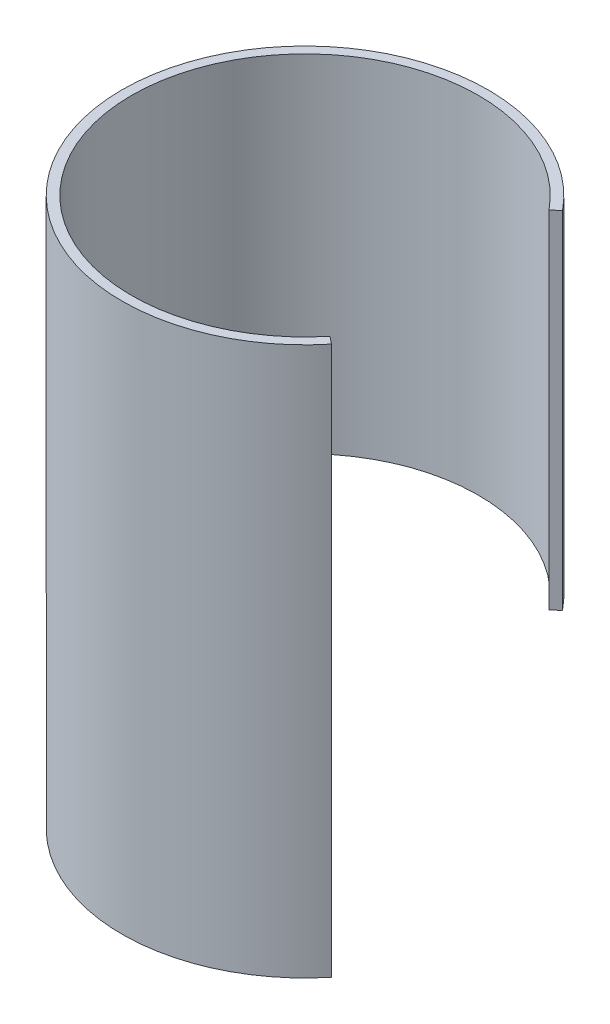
ISO-10303-21;
HEADER;
FILE_DESCRIPTION(('STEP AP214'),'2;1');
FILE_NAME('part.step','',(''),(''),'','','');
FILE_SCHEMA(('AUTOMOTIVE_DESIGN { 1 0 10303 214 1 1 1 1 }'));
ENDSEC;
DATA;
#1=APPLICATION_CONTEXT('core data for automotive mechanical design processes');
#2=APPLICATION_PROTOCOL_DEFINITION('international standard','automotive_design',2000,#1);
#3=PRODUCT_CONTEXT('',#1,'mechanical');
#4=PRODUCT('Part','Part','',(#3));
#5=PRODUCT_RELATED_PRODUCT_CATEGORY('part','',(#4));
#6=PRODUCT_DEFINITION_FORMATION('','',#4);
#7=PRODUCT_DEFINITION_CONTEXT('part definition',#1,'design');
#8=PRODUCT_DEFINITION('design','',#6,#7);
#9=PRODUCT_DEFINITION_SHAPE('','',#8);
#10=(LENGTH_UNIT() NAMED_UNIT(*) SI_UNIT(.MILLI.,.METRE.));
#11=(NAMED_UNIT(*) PLANE_ANGLE_UNIT() SI_UNIT($,.RADIAN.));
#12=(NAMED_UNIT(*) SI_UNIT($,.STERADIAN.) SOLID_ANGLE_UNIT());
#13=UNCERTAINTY_MEASURE_WITH_UNIT(LENGTH_MEASURE(1.E-05),#10,'distance_accuracy_value','');
#14=(GEOMETRIC_REPRESENTATION_CONTEXT(3) GLOBAL_UNCERTAINTY_ASSIGNED_CONTEXT((#13)) GLOBAL_UNIT_ASSIGNED_CONTEXT((#10,
#11,#12)) REPRESENTATION_CONTEXT('',''));
#15=CARTESIAN_POINT('',(0.,0.,0.));
#16=DIRECTION('',(0.,0.,1.));
#17=DIRECTION('',(1.,0.,0.));
#18=AXIS2_PLACEMENT_3D('',#15,#16,#17);
#19=CARTESIAN_POINT('',(0.,0.,0.));
#20=DIRECTION('',(0.,1.,0.));
#21=DIRECTION('',(0.,0.,1.));
#22=AXIS2_PLACEMENT_3D('',#19,#20,#21);
#23=CYLINDRICAL_SURFACE('',#22,36.05);
#24=CARTESIAN_POINT('',(0.,114.,0.));
#25=DIRECTION('',(0.,1.,0.));
#26=DIRECTION('',(0.,0.,1.));
#27=AXIS2_PLACEMENT_3D('',#24,#25,#26);
#28=CIRCLE('',#27,36.05);
#29=CARTESIAN_POINT('',(27.9566215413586,114.,22.7602682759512));
#30=VERTEX_POINT('',#29);
#31=CARTESIAN_POINT('',(27.9566215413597,114.,-22.7602682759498));
#32=VERTEX_POINT('',#31);
#33=EDGE_CURVE('E127',#30,#32,#28,.F.);
#34=ORIENTED_EDGE('',*,*,#33,.F.);
#35=DIRECTION('',(0.,1.,0.));
#36=VECTOR('',#35,1.);
#37=CARTESIAN_POINT('',(27.9566215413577,0.,22.7602682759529));
#38=LINE('',#37,#36);
#39=CARTESIAN_POINT('',(27.9566215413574,0.,22.7602682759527));
#40=VERTEX_POINT('',#39);
#41=EDGE_CURVE('E110',#40,#30,#38,.T.);
#42=ORIENTED_EDGE('',*,*,#41,.F.);
#43=CARTESIAN_POINT('',(0.,0.,0.));
#44=DIRECTION('',(0.,1.,0.));
#45=DIRECTION('',(0.,0.,1.));
#46=AXIS2_PLACEMENT_3D('',#43,#44,#45);
#47=CIRCLE('',#46,36.05);
#48=CARTESIAN_POINT('',(-35.7015755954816,0.,-5.));
#49=VERTEX_POINT('',#48);
#50=EDGE_CURVE('E113',#40,#49,#47,.F.);
#51=ORIENTED_EDGE('',*,*,#50,.T.);
#52=DIRECTION('',(0.,1.,0.));
#53=VECTOR('',#52,1.);
#54=CARTESIAN_POINT('',(-35.70157559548,18.61324865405,-5.));
#55=LINE('',#54,#53);
#56=CARTESIAN_POINT('',(-35.7015755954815,18.6132486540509,-5.));
#57=VERTEX_POINT('',#56);
#58=EDGE_CURVE('E81',#49,#57,#55,.T.);
#59=ORIENTED_EDGE('',*,*,#58,.T.);
#60=CARTESIAN_POINT('',(0.,21.5,0.));
#61=DIRECTION('',(0.,-0.866025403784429,0.500000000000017));
#62=DIRECTION('',(0.,0.500000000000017,0.866025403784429));
#63=AXIS2_PLACEMENT_3D('',#60,#61,#62);
#64=ELLIPSE('',#63,41.6269544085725,36.05);
#65=CARTESIAN_POINT('',(-36.05,21.5,0.));
#66=VERTEX_POINT('',#65);
#67=EDGE_CURVE('E21',#57,#66,#64,.F.);
#68=ORIENTED_EDGE('',*,*,#67,.T.);
#69=DIRECTION('',(0.,1.,0.));
#70=VECTOR('',#69,1.);
#71=CARTESIAN_POINT('',(-36.05,42.,0.));
#72=LINE('',#71,#70);
#73=CARTESIAN_POINT('',(-36.05,42.,0.));
#74=VERTEX_POINT('',#73);
#75=EDGE_CURVE('E86',#66,#74,#72,.T.);
#76=ORIENTED_EDGE('',*,*,#75,.T.);
#77=CARTESIAN_POINT('',(0.,42.,0.));
#78=DIRECTION('',(0.,1.,0.));
#79=DIRECTION('',(0.,0.,1.));
#80=AXIS2_PLACEMENT_3D('',#77,#78,#79);
#81=CIRCLE('',#80,36.05);
#82=CARTESIAN_POINT('',(27.9566215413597,42.,-22.7602682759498));
#83=VERTEX_POINT('',#82);
#84=EDGE_CURVE('E125',#74,#83,#81,.F.);
#85=ORIENTED_EDGE('',*,*,#84,.T.);
#86=DIRECTION('',(0.,1.,0.));
#87=VECTOR('',#86,1.);
#88=CARTESIAN_POINT('',(27.95662154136,0.,-22.76026827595));
#89=LINE('',#88,#87);
#90=EDGE_CURVE('E107',#32,#83,#89,.F.);
#91=ORIENTED_EDGE('',*,*,#90,.F.);
#92=EDGE_LOOP('',(#34,#42,#51,#59,#68,#76,#85,#91));
#93=FACE_BOUND('',#92,.T.);
#94=ADVANCED_FACE('F18',(#93),#23,.F.);
#95=CARTESIAN_POINT('',(36.26337433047,42.,0.));
#96=DIRECTION('',(0.,0.,1.));
#97=DIRECTION('',(1.,0.,0.));
#98=AXIS2_PLACEMENT_3D('',#95,#96,#97);
#99=PLANE('',#98);
#100=DIRECTION('',(1.,0.,0.));
#101=VECTOR('',#100,1.);
#102=CARTESIAN_POINT('',(36.26337433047,21.5,0.));
#103=LINE('',#102,#101);
#104=CARTESIAN_POINT('',(-38.05,21.5,0.));
#105=VERTEX_POINT('',#104);
#106=EDGE_CURVE('E89',#66,#105,#103,.F.);
#107=ORIENTED_EDGE('',*,*,#106,.T.);
#108=DIRECTION('',(0.,1.,0.));
#109=VECTOR('',#108,1.);
#110=CARTESIAN_POINT('',(-38.05,0.,0.));
#111=LINE('',#110,#109);
#112=CARTESIAN_POINT('',(-38.05,42.,0.));
#113=VERTEX_POINT('',#112);
#114=EDGE_CURVE('E124',#113,#105,#111,.F.);
#115=ORIENTED_EDGE('',*,*,#114,.F.);
#116=DIRECTION('',(1.,0.,0.));
#117=VECTOR('',#116,1.);
#118=CARTESIAN_POINT('',(36.26337433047,42.,0.));
#119=LINE('',#118,#117);
#120=EDGE_CURVE('E92',#113,#74,#119,.T.);
#121=ORIENTED_EDGE('',*,*,#120,.T.);
#122=ORIENTED_EDGE('',*,*,#75,.F.);
#123=EDGE_LOOP('',(#107,#115,#121,#122));
#124=FACE_BOUND('',#123,.T.);
#125=ADVANCED_FACE('F87',(#124),#99,.F.);
#126=CARTESIAN_POINT('',(36.26337433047,21.5,0.));
#127=DIRECTION('',(0.,-0.866025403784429,0.500000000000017));
#128=DIRECTION('',(0.,-0.500000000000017,-0.866025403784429));
#129=AXIS2_PLACEMENT_3D('',#126,#127,#128);
#130=PLANE('',#129);
#131=DIRECTION('',(1.,0.,0.));
#132=VECTOR('',#131,1.);
#133=CARTESIAN_POINT('',(36.26337433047,18.61324865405,-5.));
#134=LINE('',#133,#132);
#135=CARTESIAN_POINT('',(-37.7200543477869,18.613248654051,-4.99999999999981));
#136=VERTEX_POINT('',#135);
#137=EDGE_CURVE('E105',#57,#136,#134,.F.);
#138=ORIENTED_EDGE('',*,*,#137,.T.);
#139=CARTESIAN_POINT('',(0.,21.5,0.));
#140=DIRECTION('',(0.,-0.866025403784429,0.500000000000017));
#141=DIRECTION('',(0.,0.500000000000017,0.866025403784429));
#142=AXIS2_PLACEMENT_3D('',#139,#140,#141);
#143=ELLIPSE('',#142,43.936355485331,38.05);
#144=EDGE_CURVE('E100',#105,#136,#143,.T.);
#145=ORIENTED_EDGE('',*,*,#144,.F.);
#146=ORIENTED_EDGE('',*,*,#106,.F.);
#147=ORIENTED_EDGE('',*,*,#67,.F.);
#148=EDGE_LOOP('',(#138,#145,#146,#147));
#149=FACE_BOUND('',#148,.T.);
#150=ADVANCED_FACE('F98',(#149),#130,.F.);
#151=CARTESIAN_POINT('',(36.26337433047,18.61324865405,-5.));
#152=DIRECTION('',(0.,0.,1.));
#153=DIRECTION('',(1.,0.,0.));
#154=AXIS2_PLACEMENT_3D('',#151,#152,#153);
#155=PLANE('',#154);
#156=ORIENTED_EDGE('',*,*,#137,.F.);
#157=ORIENTED_EDGE('',*,*,#58,.F.);
#158=DIRECTION('',(1.,0.,0.));
#159=VECTOR('',#158,1.);
#160=CARTESIAN_POINT('',(0.,0.,-5.));
#161=LINE('',#160,#159);
#162=CARTESIAN_POINT('',(-37.720054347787,0.,-4.99999999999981));
#163=VERTEX_POINT('',#162);
#164=EDGE_CURVE('E129',#49,#163,#161,.F.);
#165=ORIENTED_EDGE('',*,*,#164,.T.);
#166=DIRECTION('',(0.,1.,0.));
#167=VECTOR('',#166,1.);
#168=CARTESIAN_POINT('',(-37.720054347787,0.,-4.99999999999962));
#169=LINE('',#168,#167);
#170=EDGE_CURVE('E122',#136,#163,#169,.F.);
#171=ORIENTED_EDGE('',*,*,#170,.F.);
#172=EDGE_LOOP('',(#156,#157,#165,#171));
#173=FACE_BOUND('',#172,.T.);
#174=ADVANCED_FACE('F152',(#173),#155,.F.);
#175=CARTESIAN_POINT('',(0.,0.,0.));
#176=DIRECTION('',(0.,1.,0.));
#177=DIRECTION('',(0.,0.,1.));
#178=AXIS2_PLACEMENT_3D('',#175,#176,#177);
#179=PLANE('',#178);
#180=DIRECTION('',(-0.77549574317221,0.,-0.631352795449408));
#181=VECTOR('',#180,1.);
#182=CARTESIAN_POINT('',(29.5076130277,0.,24.02297386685));
#183=LINE('',#182,#181);
#184=CARTESIAN_POINT('',(29.5076130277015,0.,24.0229738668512));
#185=VERTEX_POINT('',#184);
#186=EDGE_CURVE('E112',#185,#40,#183,.T.);
#187=ORIENTED_EDGE('',*,*,#186,.F.);
#188=CARTESIAN_POINT('',(0.,0.,0.));
#189=DIRECTION('',(0.,1.,0.));
#190=DIRECTION('',(0.,0.,1.));
#191=AXIS2_PLACEMENT_3D('',#188,#189,#190);
#192=CIRCLE('',#191,38.05);
#193=EDGE_CURVE('E119',#163,#185,#192,.T.);
#194=ORIENTED_EDGE('',*,*,#193,.F.);
#195=ORIENTED_EDGE('',*,*,#164,.F.);
#196=ORIENTED_EDGE('',*,*,#50,.F.);
#197=EDGE_LOOP('',(#187,#194,#195,#196));
#198=FACE_BOUND('',#197,.T.);
#199=ADVANCED_FACE('F154',(#198),#179,.F.);
#200=CARTESIAN_POINT('',(29.5076130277,0.,24.02297386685));
#201=DIRECTION('',(0.631352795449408,0.,-0.77549574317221));
#202=DIRECTION('',(-0.77549574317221,0.,-0.631352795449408));
#203=AXIS2_PLACEMENT_3D('',#200,#201,#202);
#204=PLANE('',#203);
#205=DIRECTION('',(0.,1.,0.));
#206=VECTOR('',#205,1.);
#207=CARTESIAN_POINT('',(29.5076130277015,0.,24.0229738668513));
#208=LINE('',#207,#206);
#209=CARTESIAN_POINT('',(29.5076130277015,114.,24.0229738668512));
#210=VERTEX_POINT('',#209);
#211=EDGE_CURVE('E118',#185,#210,#208,.T.);
#212=ORIENTED_EDGE('',*,*,#211,.F.);
#213=ORIENTED_EDGE('',*,*,#186,.T.);
#214=ORIENTED_EDGE('',*,*,#41,.T.);
#215=DIRECTION('',(-0.775495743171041,0.,-0.631352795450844));
#216=VECTOR('',#215,1.);
#217=CARTESIAN_POINT('',(29.5076130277,114.,24.02297386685));
#218=LINE('',#217,#216);
#219=EDGE_CURVE('E128',#210,#30,#218,.T.);
#220=ORIENTED_EDGE('',*,*,#219,.F.);
#221=EDGE_LOOP('',(#212,#213,#214,#220));
#222=FACE_BOUND('',#221,.T.);
#223=ADVANCED_FACE('F161',(#222),#204,.T.);
#224=CARTESIAN_POINT('',(0.,114.,0.));
#225=DIRECTION('',(0.,1.,0.));
#226=DIRECTION('',(0.,0.,1.));
#227=AXIS2_PLACEMENT_3D('',#224,#225,#226);
#228=PLANE('',#227);
#229=DIRECTION('',(0.77549574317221,0.,-0.631352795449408));
#230=VECTOR('',#229,1.);
#231=CARTESIAN_POINT('',(27.95662154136,114.,-22.76026827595));
#232=LINE('',#231,#230);
#233=CARTESIAN_POINT('',(29.5076130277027,114.,-24.0229738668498));
#234=VERTEX_POINT('',#233);
#235=EDGE_CURVE('E108',#234,#32,#232,.F.);
#236=ORIENTED_EDGE('',*,*,#235,.F.);
#237=CARTESIAN_POINT('',(0.,114.,0.));
#238=DIRECTION('',(0.,1.,0.));
#239=DIRECTION('',(0.,0.,1.));
#240=AXIS2_PLACEMENT_3D('',#237,#238,#239);
#241=CIRCLE('',#240,38.05);
#242=EDGE_CURVE('E115',#210,#234,#241,.F.);
#243=ORIENTED_EDGE('',*,*,#242,.F.);
#244=ORIENTED_EDGE('',*,*,#219,.T.);
#245=ORIENTED_EDGE('',*,*,#33,.T.);
#246=EDGE_LOOP('',(#236,#243,#244,#245));
#247=FACE_BOUND('',#246,.T.);
#248=ADVANCED_FACE('F176',(#247),#228,.T.);
#249=CARTESIAN_POINT('',(27.95662154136,0.,-22.76026827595));
#250=DIRECTION('',(0.631352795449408,0.,0.77549574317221));
#251=DIRECTION('',(0.77549574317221,0.,-0.631352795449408));
#252=AXIS2_PLACEMENT_3D('',#249,#250,#251);
#253=PLANE('',#252);
#254=ORIENTED_EDGE('',*,*,#90,.T.);
#255=DIRECTION('',(0.775495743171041,0.,-0.631352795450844));
#256=VECTOR('',#255,1.);
#257=CARTESIAN_POINT('',(27.95662154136,42.,-22.76026827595));
#258=LINE('',#257,#256);
#259=CARTESIAN_POINT('',(29.5076130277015,42.,-24.0229738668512));
#260=VERTEX_POINT('',#259);
#261=EDGE_CURVE('E36',#83,#260,#258,.T.);
#262=ORIENTED_EDGE('',*,*,#261,.T.);
#263=DIRECTION('',(0.,1.,0.));
#264=VECTOR('',#263,1.);
#265=CARTESIAN_POINT('',(29.5076130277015,0.,-24.0229738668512));
#266=LINE('',#265,#264);
#267=EDGE_CURVE('E27',#234,#260,#266,.F.);
#268=ORIENTED_EDGE('',*,*,#267,.F.);
#269=ORIENTED_EDGE('',*,*,#235,.T.);
#270=EDGE_LOOP('',(#254,#262,#268,#269));
#271=FACE_BOUND('',#270,.T.);
#272=ADVANCED_FACE('F170',(#271),#253,.T.);
#273=CARTESIAN_POINT('',(36.26337433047,42.,-38.05));
#274=DIRECTION('',(0.,1.,0.));
#275=DIRECTION('',(0.,0.,1.));
#276=AXIS2_PLACEMENT_3D('',#273,#274,#275);
#277=PLANE('',#276);
#278=ORIENTED_EDGE('',*,*,#261,.F.);
#279=ORIENTED_EDGE('',*,*,#84,.F.);
#280=ORIENTED_EDGE('',*,*,#120,.F.);
#281=CARTESIAN_POINT('',(0.,42.,0.));
#282=DIRECTION('',(0.,1.,0.));
#283=DIRECTION('',(0.,0.,1.));
#284=AXIS2_PLACEMENT_3D('',#281,#282,#283);
#285=CIRCLE('',#284,38.05);
#286=EDGE_CURVE('E11',#260,#113,#285,.T.);
#287=ORIENTED_EDGE('',*,*,#286,.F.);
#288=EDGE_LOOP('',(#278,#279,#280,#287));
#289=FACE_BOUND('',#288,.T.);
#290=ADVANCED_FACE('F166',(#289),#277,.F.);
#291=CARTESIAN_POINT('',(0.,0.,0.));
#292=DIRECTION('',(0.,1.,0.));
#293=DIRECTION('',(0.,0.,1.));
#294=AXIS2_PLACEMENT_3D('',#291,#292,#293);
#295=CYLINDRICAL_SURFACE('',#294,38.05);
#296=ORIENTED_EDGE('',*,*,#267,.T.);
#297=ORIENTED_EDGE('',*,*,#286,.T.);
#298=ORIENTED_EDGE('',*,*,#114,.T.);
#299=ORIENTED_EDGE('',*,*,#144,.T.);
#300=ORIENTED_EDGE('',*,*,#170,.T.);
#301=ORIENTED_EDGE('',*,*,#193,.T.);
#302=ORIENTED_EDGE('',*,*,#211,.T.);
#303=ORIENTED_EDGE('',*,*,#242,.T.);
#304=EDGE_LOOP('',(#296,#297,#298,#299,#300,#301,#302,#303));
#305=FACE_BOUND('',#304,.T.);
#306=ADVANCED_FACE('F151',(#305),#295,.T.);
#307=CLOSED_SHELL('',(#94,#125,#150,#174,#199,#223,#248,#272,#290,#306));
#308=MANIFOLD_SOLID_BREP('B1',#307);
#309=ADVANCED_BREP_SHAPE_REPRESENTATION('',(#18,#308),#14);
#310=SHAPE_DEFINITION_REPRESENTATION(#9,#309);
ENDSEC;
END-ISO-10303-21;
